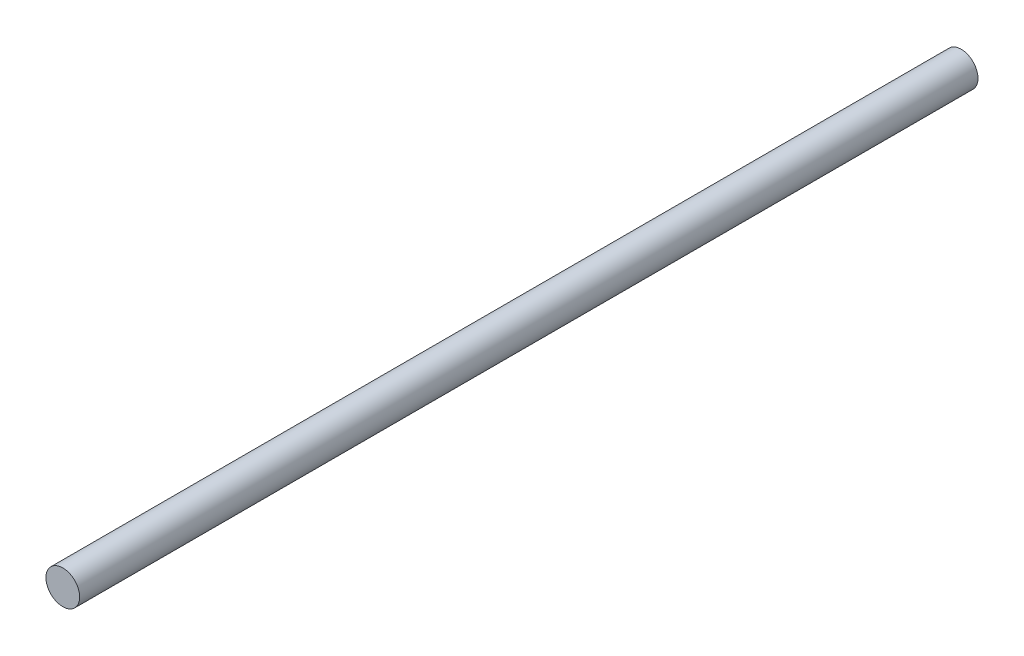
ISO-10303-21;
HEADER;
FILE_DESCRIPTION(('STEP AP214'),'2;1');
FILE_NAME('part.step','',(''),(''),'','','');
FILE_SCHEMA(('AUTOMOTIVE_DESIGN { 1 0 10303 214 1 1 1 1 }'));
ENDSEC;
DATA;
#1=APPLICATION_CONTEXT('core data for automotive mechanical design processes');
#2=APPLICATION_PROTOCOL_DEFINITION('international standard','automotive_design',2000,#1);
#3=PRODUCT_CONTEXT('',#1,'mechanical');
#4=PRODUCT('Part','Part','',(#3));
#5=PRODUCT_RELATED_PRODUCT_CATEGORY('part','',(#4));
#6=PRODUCT_DEFINITION_FORMATION('','',#4);
#7=PRODUCT_DEFINITION_CONTEXT('part definition',#1,'design');
#8=PRODUCT_DEFINITION('design','',#6,#7);
#9=PRODUCT_DEFINITION_SHAPE('','',#8);
#10=(LENGTH_UNIT() NAMED_UNIT(*) SI_UNIT(.MILLI.,.METRE.));
#11=(NAMED_UNIT(*) PLANE_ANGLE_UNIT() SI_UNIT($,.RADIAN.));
#12=(NAMED_UNIT(*) SI_UNIT($,.STERADIAN.) SOLID_ANGLE_UNIT());
#13=UNCERTAINTY_MEASURE_WITH_UNIT(LENGTH_MEASURE(1.E-05),#10,'distance_accuracy_value','');
#14=(GEOMETRIC_REPRESENTATION_CONTEXT(3) GLOBAL_UNCERTAINTY_ASSIGNED_CONTEXT((#13)) GLOBAL_UNIT_ASSIGNED_CONTEXT((#10,
#11,#12)) REPRESENTATION_CONTEXT('',''));
#15=CARTESIAN_POINT('',(0.,0.,0.));
#16=DIRECTION('',(0.,0.,1.));
#17=DIRECTION('',(1.,0.,0.));
#18=AXIS2_PLACEMENT_3D('',#15,#16,#17);
#19=CARTESIAN_POINT('',(0.,0.,-1600.));
#20=DIRECTION('',(0.,0.,1.));
#21=DIRECTION('',(1.,0.,0.));
#22=AXIS2_PLACEMENT_3D('',#19,#20,#21);
#23=CYLINDRICAL_SURFACE('',#22,30.);
#24=CARTESIAN_POINT('',(0.,0.,-1600.));
#25=DIRECTION('',(0.,0.,1.));
#26=DIRECTION('',(1.,0.,0.));
#27=AXIS2_PLACEMENT_3D('',#24,#25,#26);
#28=CIRCLE('',#27,30.);
#29=CARTESIAN_POINT('',(30.,0.,-1600.));
#30=VERTEX_POINT('',#29);
#31=EDGE_CURVE('E10',#30,#30,#28,.T.);
#32=ORIENTED_EDGE('',*,*,#31,.T.);
#33=EDGE_LOOP('',(#32));
#34=FACE_BOUND('',#33,.T.);
#35=CARTESIAN_POINT('',(0.,0.,0.));
#36=DIRECTION('',(0.,0.,1.));
#37=DIRECTION('',(1.,0.,0.));
#38=AXIS2_PLACEMENT_3D('',#35,#36,#37);
#39=CIRCLE('',#38,30.);
#40=CARTESIAN_POINT('',(30.,0.,0.));
#41=VERTEX_POINT('',#40);
#42=EDGE_CURVE('E40',#41,#41,#39,.T.);
#43=ORIENTED_EDGE('',*,*,#42,.F.);
#44=EDGE_LOOP('',(#43));
#45=FACE_BOUND('',#44,.T.);
#46=ADVANCED_FACE('F37',(#34,#45),#23,.T.);
#47=CARTESIAN_POINT('',(0.,0.,-1600.));
#48=DIRECTION('',(0.,0.,1.));
#49=DIRECTION('',(1.,0.,0.));
#50=AXIS2_PLACEMENT_3D('',#47,#48,#49);
#51=PLANE('',#50);
#52=ORIENTED_EDGE('',*,*,#31,.F.);
#53=EDGE_LOOP('',(#52));
#54=FACE_BOUND('',#53,.T.);
#55=ADVANCED_FACE('F54',(#54),#51,.F.);
#56=CARTESIAN_POINT('',(0.,0.,0.));
#57=DIRECTION('',(0.,0.,1.));
#58=DIRECTION('',(1.,0.,0.));
#59=AXIS2_PLACEMENT_3D('',#56,#57,#58);
#60=PLANE('',#59);
#61=ORIENTED_EDGE('',*,*,#42,.T.);
#62=EDGE_LOOP('',(#61));
#63=FACE_BOUND('',#62,.T.);
#64=ADVANCED_FACE('F51',(#63),#60,.T.);
#65=CLOSED_SHELL('',(#46,#55,#64));
#66=MANIFOLD_SOLID_BREP('B2',#65);
#67=ADVANCED_BREP_SHAPE_REPRESENTATION('',(#18,#66),#14);
#68=SHAPE_DEFINITION_REPRESENTATION(#9,#67);
ENDSEC;
END-ISO-10303-21;
